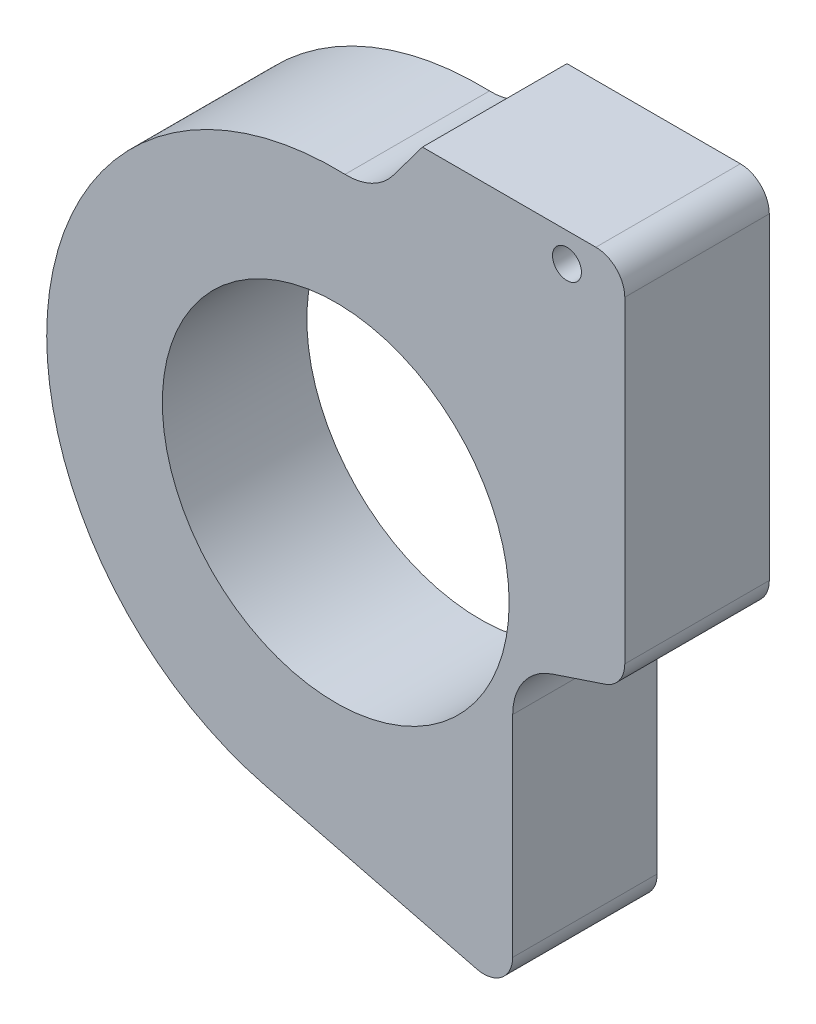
from build123d import *

# Parameters (mm, degrees)
ESQUISSE1_R          = 6
ESQUISSE1_R_2        = 0.5
BASE_EXTRUSION_DEPTH = 5


with BuildPart() as part:
    # Esquisse1 → Base-Extrusion (new body)
    with BuildSketch(Plane.XY):
        with BuildLine():
            Line((-2.436303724, -9.698681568), (4.878184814, -11.536077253))
            ThreePointArc((4.878184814, -11.536077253), (5.736782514, -11.354761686), (6.121815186, -10.566209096))
            Line((6.121815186, -10.566209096), (6.121815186, -3.289816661))
            ThreePointArc((6.121815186, -3.289816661), (6.49918609, -2.120596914), (7.488890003, -1.39260668))
            Line((7.488890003, -1.39260668), (9.316462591, -0.782913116))
            ThreePointArc((9.316462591, -0.782913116), (9.811314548, -0.418917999), (10, 0.165691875))
            Line((10, 0.165691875), (10, 11.151523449))
            ThreePointArc((10, 11.151523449), (9.707106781, 11.858630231), (9, 12.151523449))
            Line((9, 12.151523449), (3, 12.151523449))
            Line((3, 12.151523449), (1.987549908, 10.796627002))
            ThreePointArc((1.987549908, 10.796627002), (1.252605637, 10.191580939), (0.321199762, 9.994840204))
            ThreePointArc((0.321199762, 9.994840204), (-9.903389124, 1.386680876), (-2.436303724, -9.698681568))
        make_face()
        Circle(ESQUISSE1_R, mode=Mode.SUBTRACT)
        with Locations((8, 11.151523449)):
            Circle(ESQUISSE1_R_2, mode=Mode.SUBTRACT)
    extrude(amount=-BASE_EXTRUSION_DEPTH)


solid = part.part
